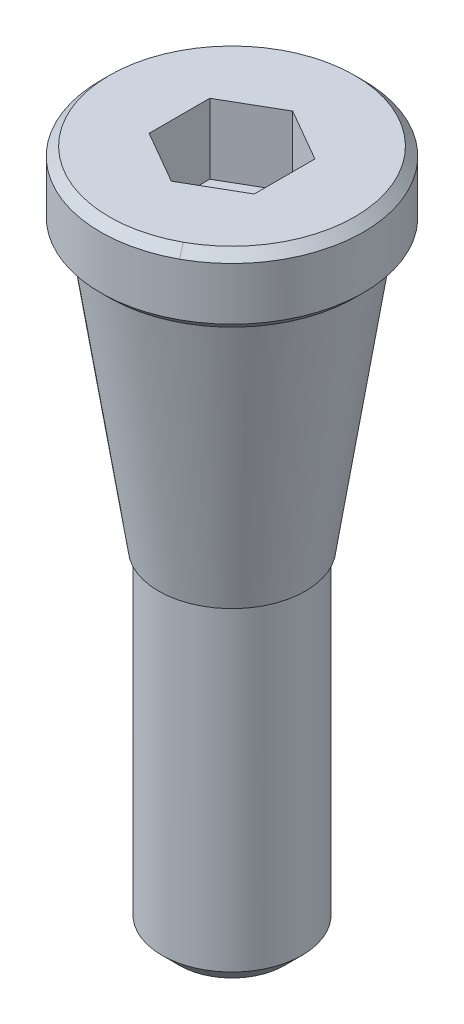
ISO-10303-21;
HEADER;
FILE_DESCRIPTION(('STEP AP214'),'2;1');
FILE_NAME('part.step','',(''),(''),'','','');
FILE_SCHEMA(('AUTOMOTIVE_DESIGN { 1 0 10303 214 1 1 1 1 }'));
ENDSEC;
DATA;
#1=APPLICATION_CONTEXT('core data for automotive mechanical design processes');
#2=APPLICATION_PROTOCOL_DEFINITION('international standard','automotive_design',2000,#1);
#3=PRODUCT_CONTEXT('',#1,'mechanical');
#4=PRODUCT('Part','Part','',(#3));
#5=PRODUCT_RELATED_PRODUCT_CATEGORY('part','',(#4));
#6=PRODUCT_DEFINITION_FORMATION('','',#4);
#7=PRODUCT_DEFINITION_CONTEXT('part definition',#1,'design');
#8=PRODUCT_DEFINITION('design','',#6,#7);
#9=PRODUCT_DEFINITION_SHAPE('','',#8);
#10=(LENGTH_UNIT() NAMED_UNIT(*) SI_UNIT(.MILLI.,.METRE.));
#11=(NAMED_UNIT(*) PLANE_ANGLE_UNIT() SI_UNIT($,.RADIAN.));
#12=(NAMED_UNIT(*) SI_UNIT($,.STERADIAN.) SOLID_ANGLE_UNIT());
#13=UNCERTAINTY_MEASURE_WITH_UNIT(LENGTH_MEASURE(1.E-05),#10,'distance_accuracy_value','');
#14=(GEOMETRIC_REPRESENTATION_CONTEXT(3) GLOBAL_UNCERTAINTY_ASSIGNED_CONTEXT((#13)) GLOBAL_UNIT_ASSIGNED_CONTEXT((#10,
#11,#12)) REPRESENTATION_CONTEXT('',''));
#15=CARTESIAN_POINT('',(0.,0.,0.));
#16=DIRECTION('',(0.,0.,1.));
#17=DIRECTION('',(1.,0.,0.));
#18=AXIS2_PLACEMENT_3D('',#15,#16,#17);
#19=CARTESIAN_POINT('',(0.,25.,7.50000000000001));
#20=DIRECTION('',(0.,1.,0.));
#21=DIRECTION('',(0.,0.,1.));
#22=AXIS2_PLACEMENT_3D('',#19,#20,#21);
#23=PLANE('',#22);
#24=DIRECTION('',(0.866025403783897,0.,-0.50000000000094));
#25=VECTOR('',#24,1.);
#26=CARTESIAN_POINT('',(-3.71924713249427E-12,25.,-3.46410161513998));
#27=LINE('',#26,#25);
#28=CARTESIAN_POINT('',(-2.99999999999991,25.,-1.73205080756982));
#29=VERTEX_POINT('',#28);
#30=CARTESIAN_POINT('',(-3.03923552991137E-12,25.,-3.46410161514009));
#31=VERTEX_POINT('',#30);
#32=EDGE_CURVE('E94',#29,#31,#27,.T.);
#33=ORIENTED_EDGE('',*,*,#32,.F.);
#34=DIRECTION('',(0.,0.,1.));
#35=VECTOR('',#34,1.);
#36=CARTESIAN_POINT('',(-2.99999999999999,25.,1.73205080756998));
#37=LINE('',#36,#35);
#38=CARTESIAN_POINT('',(-3.00000000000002,25.,1.73205080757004));
#39=VERTEX_POINT('',#38);
#40=EDGE_CURVE('E280',#29,#39,#37,.T.);
#41=ORIENTED_EDGE('',*,*,#40,.T.);
#42=DIRECTION('',(0.86602540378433,0.,0.50000000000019));
#43=VECTOR('',#42,1.);
#44=CARTESIAN_POINT('',(0.,25.,3.46410161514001));
#45=LINE('',#44,#43);
#46=CARTESIAN_POINT('',(0.,25.,3.46410161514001));
#47=VERTEX_POINT('',#46);
#48=EDGE_CURVE('E287',#39,#47,#45,.T.);
#49=ORIENTED_EDGE('',*,*,#48,.T.);
#50=DIRECTION('',(-0.866025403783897,0.,0.50000000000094));
#51=VECTOR('',#50,1.);
#52=CARTESIAN_POINT('',(0.,25.,3.46410161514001));
#53=LINE('',#52,#51);
#54=CARTESIAN_POINT('',(2.99999999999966,25.,1.73205080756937));
#55=VERTEX_POINT('',#54);
#56=EDGE_CURVE('E304',#55,#47,#53,.T.);
#57=ORIENTED_EDGE('',*,*,#56,.F.);
#58=DIRECTION('',(0.,0.,1.));
#59=VECTOR('',#58,1.);
#60=CARTESIAN_POINT('',(3.00000000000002,25.,1.73205080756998));
#61=LINE('',#60,#59);
#62=CARTESIAN_POINT('',(2.99999999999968,25.,-1.73205080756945));
#63=VERTEX_POINT('',#62);
#64=EDGE_CURVE('E301',#63,#55,#61,.T.);
#65=ORIENTED_EDGE('',*,*,#64,.F.);
#66=DIRECTION('',(-0.86602540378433,0.,-0.50000000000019));
#67=VECTOR('',#66,1.);
#68=CARTESIAN_POINT('',(-2.96984659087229E-12,25.,-3.46410161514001));
#69=LINE('',#68,#67);
#70=EDGE_CURVE('E98',#63,#31,#69,.T.);
#71=ORIENTED_EDGE('',*,*,#70,.T.);
#72=EDGE_LOOP('',(#33,#41,#49,#57,#65,#71));
#73=FACE_BOUND('',#72,.T.);
#74=ADVANCED_FACE('F16',(#73),#23,.T.);
#75=CARTESIAN_POINT('',(-3.71924713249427E-12,29.,-3.46410161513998));
#76=DIRECTION('',(0.50000000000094,0.,0.866025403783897));
#77=DIRECTION('',(0.866025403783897,0.,-0.50000000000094));
#78=AXIS2_PLACEMENT_3D('',#75,#76,#77);
#79=PLANE('',#78);
#80=DIRECTION('',(0.,1.,0.));
#81=VECTOR('',#80,1.);
#82=CARTESIAN_POINT('',(-3.,29.,-1.73205080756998));
#83=LINE('',#82,#81);
#84=CARTESIAN_POINT('',(-2.99999999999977,29.,-1.73205080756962));
#85=VERTEX_POINT('',#84);
#86=EDGE_CURVE('E113',#85,#29,#83,.F.);
#87=ORIENTED_EDGE('',*,*,#86,.T.);
#88=ORIENTED_EDGE('',*,*,#32,.T.);
#89=DIRECTION('',(0.,1.,0.));
#90=VECTOR('',#89,1.);
#91=CARTESIAN_POINT('',(-2.96984659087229E-12,29.,-3.46410161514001));
#92=LINE('',#91,#90);
#93=CARTESIAN_POINT('',(-3.08086889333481E-12,29.,-3.46410161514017));
#94=VERTEX_POINT('',#93);
#95=EDGE_CURVE('E85',#31,#94,#92,.T.);
#96=ORIENTED_EDGE('',*,*,#95,.T.);
#97=DIRECTION('',(0.866025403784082,0.,-0.500000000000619));
#98=VECTOR('',#97,1.);
#99=CARTESIAN_POINT('',(-3.,29.,-1.73205080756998));
#100=LINE('',#99,#98);
#101=EDGE_CURVE('E90',#85,#94,#100,.T.);
#102=ORIENTED_EDGE('',*,*,#101,.F.);
#103=EDGE_LOOP('',(#87,#88,#96,#102));
#104=FACE_BOUND('',#103,.T.);
#105=ADVANCED_FACE('F88',(#104),#79,.T.);
#106=CARTESIAN_POINT('',(-2.96984659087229E-12,29.,-3.46410161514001));
#107=DIRECTION('',(0.50000000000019,0.,-0.86602540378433));
#108=DIRECTION('',(-0.86602540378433,0.,-0.50000000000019));
#109=AXIS2_PLACEMENT_3D('',#106,#107,#108);
#110=PLANE('',#109);
#111=DIRECTION('',(0.866025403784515,0.,0.499999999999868));
#112=VECTOR('',#111,1.);
#113=CARTESIAN_POINT('',(-2.96984659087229E-12,29.,-3.46410161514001));
#114=LINE('',#113,#112);
#115=CARTESIAN_POINT('',(2.99999999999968,29.,-1.73205080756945));
#116=VERTEX_POINT('',#115);
#117=EDGE_CURVE('E101',#94,#116,#114,.T.);
#118=ORIENTED_EDGE('',*,*,#117,.F.);
#119=ORIENTED_EDGE('',*,*,#95,.F.);
#120=ORIENTED_EDGE('',*,*,#70,.F.);
#121=DIRECTION('',(0.,1.,0.));
#122=VECTOR('',#121,1.);
#123=CARTESIAN_POINT('',(3.,29.,-1.73205080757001));
#124=LINE('',#123,#122);
#125=EDGE_CURVE('E97',#116,#63,#124,.F.);
#126=ORIENTED_EDGE('',*,*,#125,.F.);
#127=EDGE_LOOP('',(#118,#119,#120,#126));
#128=FACE_BOUND('',#127,.T.);
#129=ADVANCED_FACE('F102',(#128),#110,.F.);
#130=CARTESIAN_POINT('',(3.00000000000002,29.,1.73205080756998));
#131=DIRECTION('',(-1.,0.,0.));
#132=DIRECTION('',(0.,0.,1.));
#133=AXIS2_PLACEMENT_3D('',#130,#131,#132);
#134=PLANE('',#133);
#135=ORIENTED_EDGE('',*,*,#125,.T.);
#136=ORIENTED_EDGE('',*,*,#64,.T.);
#137=DIRECTION('',(0.,1.,0.));
#138=VECTOR('',#137,1.);
#139=CARTESIAN_POINT('',(2.9999999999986,29.,1.73205080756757));
#140=LINE('',#139,#138);
#141=CARTESIAN_POINT('',(2.99999999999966,29.,1.73205080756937));
#142=VERTEX_POINT('',#141);
#143=EDGE_CURVE('E299',#142,#55,#140,.F.);
#144=ORIENTED_EDGE('',*,*,#143,.F.);
#145=DIRECTION('',(0.,0.,1.));
#146=VECTOR('',#145,1.);
#147=CARTESIAN_POINT('',(3.00000000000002,29.,7.49999999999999));
#148=LINE('',#147,#146);
#149=EDGE_CURVE('E107',#116,#142,#148,.T.);
#150=ORIENTED_EDGE('',*,*,#149,.F.);
#151=EDGE_LOOP('',(#135,#136,#144,#150));
#152=FACE_BOUND('',#151,.T.);
#153=ADVANCED_FACE('F262',(#152),#134,.T.);
#154=CARTESIAN_POINT('',(0.,29.,3.46410161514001));
#155=DIRECTION('',(-0.50000000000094,0.,-0.866025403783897));
#156=DIRECTION('',(-0.866025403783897,0.,0.50000000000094));
#157=AXIS2_PLACEMENT_3D('',#154,#155,#156);
#158=PLANE('',#157);
#159=ORIENTED_EDGE('',*,*,#143,.T.);
#160=ORIENTED_EDGE('',*,*,#56,.T.);
#161=DIRECTION('',(0.,1.,0.));
#162=VECTOR('',#161,1.);
#163=CARTESIAN_POINT('',(0.,29.,3.46410161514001));
#164=LINE('',#163,#162);
#165=CARTESIAN_POINT('',(0.,29.,3.46410161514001));
#166=VERTEX_POINT('',#165);
#167=EDGE_CURVE('E284',#47,#166,#164,.T.);
#168=ORIENTED_EDGE('',*,*,#167,.T.);
#169=DIRECTION('',(-0.866025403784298,0.,0.500000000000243));
#170=VECTOR('',#169,1.);
#171=CARTESIAN_POINT('',(3.00000000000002,29.,1.73205080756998));
#172=LINE('',#171,#170);
#173=EDGE_CURVE('E293',#142,#166,#172,.T.);
#174=ORIENTED_EDGE('',*,*,#173,.F.);
#175=EDGE_LOOP('',(#159,#160,#168,#174));
#176=FACE_BOUND('',#175,.T.);
#177=ADVANCED_FACE('F259',(#176),#158,.T.);
#178=CARTESIAN_POINT('',(0.,29.,3.46410161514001));
#179=DIRECTION('',(-0.50000000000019,0.,0.86602540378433));
#180=DIRECTION('',(0.86602540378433,0.,0.50000000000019));
#181=AXIS2_PLACEMENT_3D('',#178,#179,#180);
#182=PLANE('',#181);
#183=DIRECTION('',(-0.866025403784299,0.,-0.500000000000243));
#184=VECTOR('',#183,1.);
#185=CARTESIAN_POINT('',(0.,29.,3.46410161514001));
#186=LINE('',#185,#184);
#187=CARTESIAN_POINT('',(-3.00000000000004,29.,1.73205080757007));
#188=VERTEX_POINT('',#187);
#189=EDGE_CURVE('E291',#166,#188,#186,.T.);
#190=ORIENTED_EDGE('',*,*,#189,.F.);
#191=ORIENTED_EDGE('',*,*,#167,.F.);
#192=ORIENTED_EDGE('',*,*,#48,.F.);
#193=DIRECTION('',(0.,1.,0.));
#194=VECTOR('',#193,1.);
#195=CARTESIAN_POINT('',(-2.99999999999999,29.,1.73205080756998));
#196=LINE('',#195,#194);
#197=EDGE_CURVE('E64',#39,#188,#196,.T.);
#198=ORIENTED_EDGE('',*,*,#197,.T.);
#199=EDGE_LOOP('',(#190,#191,#192,#198));
#200=FACE_BOUND('',#199,.T.);
#201=ADVANCED_FACE('F253',(#200),#182,.F.);
#202=CARTESIAN_POINT('',(-2.99999999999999,29.,1.73205080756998));
#203=DIRECTION('',(-1.,0.,0.));
#204=DIRECTION('',(0.,0.,1.));
#205=AXIS2_PLACEMENT_3D('',#202,#203,#204);
#206=PLANE('',#205);
#207=DIRECTION('',(0.,0.,1.));
#208=VECTOR('',#207,1.);
#209=CARTESIAN_POINT('',(-2.99999999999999,29.,7.49999999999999));
#210=LINE('',#209,#208);
#211=EDGE_CURVE('E112',#188,#85,#210,.F.);
#212=ORIENTED_EDGE('',*,*,#211,.F.);
#213=ORIENTED_EDGE('',*,*,#197,.F.);
#214=ORIENTED_EDGE('',*,*,#40,.F.);
#215=ORIENTED_EDGE('',*,*,#86,.F.);
#216=EDGE_LOOP('',(#212,#213,#214,#215));
#217=FACE_BOUND('',#216,.T.);
#218=ADVANCED_FACE('F249',(#217),#206,.F.);
#219=CARTESIAN_POINT('',(0.,29.,7.50000000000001));
#220=DIRECTION('',(0.,1.,0.));
#221=DIRECTION('',(0.,0.,1.));
#222=AXIS2_PLACEMENT_3D('',#219,#220,#221);
#223=PLANE('',#222);
#224=ORIENTED_EDGE('',*,*,#189,.T.);
#225=ORIENTED_EDGE('',*,*,#211,.T.);
#226=ORIENTED_EDGE('',*,*,#101,.T.);
#227=ORIENTED_EDGE('',*,*,#117,.T.);
#228=ORIENTED_EDGE('',*,*,#149,.T.);
#229=ORIENTED_EDGE('',*,*,#173,.T.);
#230=EDGE_LOOP('',(#224,#225,#226,#227,#228,#229));
#231=FACE_BOUND('',#230,.T.);
#232=CARTESIAN_POINT('',(0.,29.0000000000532,0.));
#233=DIRECTION('',(0.,-1.,0.));
#234=DIRECTION('',(1.,0.,0.));
#235=AXIS2_PLACEMENT_3D('',#232,#233,#234);
#236=CIRCLE('',#235,7.00000000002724);
#237=CARTESIAN_POINT('',(3.3559787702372,28.999999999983,6.14307793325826));
#238=VERTEX_POINT('',#237);
#239=CARTESIAN_POINT('',(-3.35597876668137,28.999999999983,-6.14307793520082));
#240=VERTEX_POINT('',#239);
#241=EDGE_CURVE('E20',#238,#240,#236,.T.);
#242=ORIENTED_EDGE('',*,*,#241,.F.);
#243=CARTESIAN_POINT('',(0.,28.9999999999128,0.));
#244=DIRECTION('',(0.,-1.,0.));
#245=DIRECTION('',(0.,0.,-1.));
#246=AXIS2_PLACEMENT_3D('',#243,#244,#245);
#247=CIRCLE('',#246,7.00000000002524);
#248=EDGE_CURVE('E157',#240,#238,#247,.T.);
#249=ORIENTED_EDGE('',*,*,#248,.F.);
#250=EDGE_LOOP('',(#242,#249));
#251=FACE_BOUND('',#250,.T.);
#252=ADVANCED_FACE('F111',(#231,#251),#223,.T.);
#253=CARTESIAN_POINT('',(0.,28.5000000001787,0.));
#254=DIRECTION('',(0.,-1.,0.));
#255=DIRECTION('',(1.,0.,0.));
#256=AXIS2_PLACEMENT_3D('',#253,#254,#255);
#257=CONICAL_SURFACE('',#256,7.49999999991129,0.785398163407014);
#258=DIRECTION('',(-0.339005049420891,0.707106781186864,-0.620544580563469));
#259=VECTOR('',#258,1.);
#260=CARTESIAN_POINT('',(239250.603082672,-499000.,437945.291355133));
#261=LINE('',#260,#259);
#262=CARTESIAN_POINT('',(3.59569153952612,28.500000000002,6.58186921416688));
#263=VERTEX_POINT('',#262);
#264=EDGE_CURVE('E165',#238,#263,#261,.F.);
#265=ORIENTED_EDGE('',*,*,#264,.F.);
#266=ORIENTED_EDGE('',*,*,#241,.T.);
#267=CARTESIAN_POINT('',(-3.59569153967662,28.5000000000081,-6.58186921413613));
#268=CARTESIAN_POINT('',(-3.58570350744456,28.5208333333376,-6.56358624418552));
#269=CARTESIAN_POINT('',(-3.57571547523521,28.5416666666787,-6.54530327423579));
#270=CARTESIAN_POINT('',(-3.55573941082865,28.5833333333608,-6.50873733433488));
#271=CARTESIAN_POINT('',(-3.54575137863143,28.6041666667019,-6.49045436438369));
#272=CARTESIAN_POINT('',(-3.52577531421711,28.6458333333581,-6.45388842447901));
#273=CARTESIAN_POINT('',(-3.51578728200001,28.6666666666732,-6.4356054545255));
#274=CARTESIAN_POINT('',(-3.49581121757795,28.7083333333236,-6.39903951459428));
#275=CARTESIAN_POINT('',(-3.48582318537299,28.7291666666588,-6.38075654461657));
#276=CARTESIAN_POINT('',(-3.4658471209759,28.770833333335,-6.34419060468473));
#277=CARTESIAN_POINT('',(-3.45585908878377,28.791666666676,-6.3259076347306));
#278=CARTESIAN_POINT('',(-3.43588302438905,28.8333333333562,-6.28934169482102));
#279=CARTESIAN_POINT('',(-3.42589499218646,28.8541666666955,-6.27105872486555));
#280=CARTESIAN_POINT('',(-3.4059189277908,28.8958333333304,-6.23449278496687));
#281=CARTESIAN_POINT('',(-3.39593089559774,28.9166666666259,-6.21620981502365));
#282=CARTESIAN_POINT('',(-3.37595483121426,28.9583333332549,-6.17964387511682));
#283=CARTESIAN_POINT('',(-3.36596679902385,28.9791666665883,-6.1613609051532));
#284=CARTESIAN_POINT('',(-3.35597876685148,28.9999999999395,-6.14307793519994));
#285=B_SPLINE_CURVE_WITH_KNOTS('',3,(#267,#268,#269,#270,#271,#272,#273,#274,#275,#276,#277,
#278,#279,#280,#281,#282,#283,#284),.UNSPECIFIED.,.F.,.F.,(4,2,2,2,2,2,2,2,4),(0.,
0.0883883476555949,0.176776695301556,0.265165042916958,0.353553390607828,0.441941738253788,
0.530330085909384,0.618718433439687,0.707106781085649),.UNSPECIFIED.);
#286=CARTESIAN_POINT('',(-3.59569153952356,28.500000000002,-6.58186921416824));
#287=VERTEX_POINT('',#286);
#288=EDGE_CURVE('E134',#287,#240,#285,.T.);
#289=ORIENTED_EDGE('',*,*,#288,.F.);
#290=CARTESIAN_POINT('',(0.,28.5,0.));
#291=DIRECTION('',(0.,1.,0.));
#292=DIRECTION('',(0.,0.,1.));
#293=AXIS2_PLACEMENT_3D('',#290,#291,#292);
#294=CIRCLE('',#293,7.5);
#295=EDGE_CURVE('E159',#263,#287,#294,.F.);
#296=ORIENTED_EDGE('',*,*,#295,.F.);
#297=EDGE_LOOP('',(#265,#266,#289,#296));
#298=FACE_BOUND('',#297,.T.);
#299=ADVANCED_FACE('F126',(#298),#257,.T.);
#300=CARTESIAN_POINT('',(0.,28.5000000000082,0.));
#301=DIRECTION('',(0.,-1.,0.));
#302=DIRECTION('',(0.,0.,-1.));
#303=AXIS2_PLACEMENT_3D('',#300,#301,#302);
#304=CONICAL_SURFACE('',#303,7.49999999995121,0.785398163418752);
#305=ORIENTED_EDGE('',*,*,#288,.T.);
#306=ORIENTED_EDGE('',*,*,#248,.T.);
#307=ORIENTED_EDGE('',*,*,#264,.T.);
#308=CARTESIAN_POINT('',(0.,28.5,0.));
#309=DIRECTION('',(0.,1.,0.));
#310=DIRECTION('',(0.,0.,1.));
#311=AXIS2_PLACEMENT_3D('',#308,#309,#310);
#312=CIRCLE('',#311,7.5);
#313=EDGE_CURVE('E156',#287,#263,#312,.F.);
#314=ORIENTED_EDGE('',*,*,#313,.F.);
#315=EDGE_LOOP('',(#305,#306,#307,#314));
#316=FACE_BOUND('',#315,.T.);
#317=ADVANCED_FACE('F128',(#316),#304,.T.);
#318=CARTESIAN_POINT('',(0.,-9.99999999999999,4.00000000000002));
#319=DIRECTION('',(0.,1.,0.));
#320=DIRECTION('',(0.,0.,1.));
#321=AXIS2_PLACEMENT_3D('',#318,#319,#320);
#322=PLANE('',#321);
#323=CARTESIAN_POINT('',(0.,-9.999999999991,0.));
#324=DIRECTION('',(0.,1.,0.));
#325=DIRECTION('',(0.,0.,1.));
#326=AXIS2_PLACEMENT_3D('',#323,#324,#325);
#327=CIRCLE('',#326,3.00000000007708);
#328=CARTESIAN_POINT('',(-1.43827649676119,-9.99999999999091,-2.63274775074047));
#329=VERTEX_POINT('',#328);
#330=CARTESIAN_POINT('',(1.43827661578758,-9.99999999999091,2.63274768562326));
#331=VERTEX_POINT('',#330);
#332=EDGE_CURVE('E151',#329,#331,#327,.T.);
#333=ORIENTED_EDGE('',*,*,#332,.F.);
#334=CARTESIAN_POINT('',(0.,-9.99999999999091,0.));
#335=DIRECTION('',(0.,1.,0.));
#336=DIRECTION('',(0.,0.,1.));
#337=AXIS2_PLACEMENT_3D('',#334,#335,#336);
#338=CIRCLE('',#337,2.99999999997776);
#339=EDGE_CURVE('E155',#331,#329,#338,.T.);
#340=ORIENTED_EDGE('',*,*,#339,.F.);
#341=EDGE_LOOP('',(#333,#340));
#342=FACE_BOUND('',#341,.T.);
#343=ADVANCED_FACE('F234',(#342),#322,.F.);
#344=CARTESIAN_POINT('',(0.,9.49999999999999,0.));
#345=DIRECTION('',(0.,1.,0.));
#346=DIRECTION('',(0.,0.,1.));
#347=AXIS2_PLACEMENT_3D('',#344,#345,#346);
#348=CYLINDRICAL_SURFACE('',#347,7.5);
#349=ORIENTED_EDGE('',*,*,#295,.T.);
#350=ORIENTED_EDGE('',*,*,#313,.T.);
#351=EDGE_LOOP('',(#349,#350));
#352=FACE_BOUND('',#351,.T.);
#353=CARTESIAN_POINT('',(0.,25.5000000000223,0.));
#354=DIRECTION('',(0.,1.,0.));
#355=DIRECTION('',(0.479425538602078,0.,0.877582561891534));
#356=AXIS2_PLACEMENT_3D('',#353,#354,#355);
#357=CIRCLE('',#356,7.5000000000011);
#358=CARTESIAN_POINT('',(3.59569153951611,25.5000000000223,6.58186921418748));
#359=VERTEX_POINT('',#358);
#360=EDGE_CURVE('E176',#359,#359,#357,.F.);
#361=ORIENTED_EDGE('',*,*,#360,.F.);
#362=EDGE_LOOP('',(#361));
#363=FACE_BOUND('',#362,.T.);
#364=ADVANCED_FACE('F232',(#352,#363),#348,.T.);
#365=CARTESIAN_POINT('',(0.,-9.00000000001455,0.));
#366=DIRECTION('',(0.,1.,0.));
#367=DIRECTION('',(0.,0.,1.));
#368=AXIS2_PLACEMENT_3D('',#365,#366,#367);
#369=CONICAL_SURFACE('',#368,3.99999999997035,0.785398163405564);
#370=CARTESIAN_POINT('',(-1.91770215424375,-9.0000000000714,-3.51033024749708));
#371=CARTESIAN_POINT('',(-1.89772608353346,-9.04166666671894,-3.47376431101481));
#372=CARTESIAN_POINT('',(-1.87775001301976,-9.08333333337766,-3.43719837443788));
#373=CARTESIAN_POINT('',(-1.83779787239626,-9.16666666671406,-3.36406650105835));
#374=CARTESIAN_POINT('',(-1.81782180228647,-9.20833333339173,-3.32750056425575));
#375=CARTESIAN_POINT('',(-1.77786966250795,-9.2916666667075,-3.25436869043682));
#376=CARTESIAN_POINT('',(-1.75789359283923,-9.33333333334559,-3.2178027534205));
#377=CARTESIAN_POINT('',(-1.71794145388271,-9.4166666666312,-3.14467087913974));
#378=CARTESIAN_POINT('',(-1.69796538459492,-9.45833333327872,-3.1081049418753));
#379=CARTESIAN_POINT('',(-1.65801324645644,-9.54166666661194,-3.0349730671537));
#380=CARTESIAN_POINT('',(-1.63803717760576,-9.58333333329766,-2.99840712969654));
#381=CARTESIAN_POINT('',(-1.59808504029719,-9.66666666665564,-2.92527525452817));
#382=CARTESIAN_POINT('',(-1.5781089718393,-9.70833333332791,-2.88870931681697));
#383=CARTESIAN_POINT('',(-1.53815683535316,-9.79166666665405,-2.81557744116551));
#384=CARTESIAN_POINT('',(-1.51818076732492,-9.83333333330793,-2.77901150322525));
#385=CARTESIAN_POINT('',(-1.47822863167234,-9.91666666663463,-2.70587962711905));
#386=CARTESIAN_POINT('',(-1.458252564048,-9.95833333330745,-2.66931368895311));
#387=CARTESIAN_POINT('',(-1.43827649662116,-9.99999999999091,-2.63274775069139));
#388=B_SPLINE_CURVE_WITH_KNOTS('',3,(#370,#371,#372,#373,#374,#375,#376,#377,#378,#379,#380,
#381,#382,#383,#384,#385,#386,#387),.UNSPECIFIED.,.F.,.F.,(4,2,2,2,2,2,2,2,4),(0.,
0.176776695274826,0.353553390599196,0.530330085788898,0.707106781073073,0.883883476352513,
1.06066017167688,1.23743686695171,1.41421356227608),.UNSPECIFIED.);
#389=CARTESIAN_POINT('',(-1.91770215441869,-9.00000000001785,-3.51033024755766));
#390=VERTEX_POINT('',#389);
#391=EDGE_CURVE('E35',#390,#329,#388,.T.);
#392=ORIENTED_EDGE('',*,*,#391,.F.);
#393=CARTESIAN_POINT('',(0.,-9.00000000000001,0.));
#394=DIRECTION('',(0.,1.,0.));
#395=DIRECTION('',(0.,0.,1.));
#396=AXIS2_PLACEMENT_3D('',#393,#394,#395);
#397=CIRCLE('',#396,4.);
#398=CARTESIAN_POINT('',(1.91770215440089,-9.00000000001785,3.51033024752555));
#399=VERTEX_POINT('',#398);
#400=EDGE_CURVE('E179',#399,#390,#397,.T.);
#401=ORIENTED_EDGE('',*,*,#400,.F.);
#402=DIRECTION('',(-0.339005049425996,-0.707106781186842,-0.620544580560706));
#403=VECTOR('',#402,1.);
#404=CARTESIAN_POINT('',(239239.576298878,498999.999999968,437925.106954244));
#405=LINE('',#404,#403);
#406=EDGE_CURVE('E154',#331,#399,#405,.F.);
#407=ORIENTED_EDGE('',*,*,#406,.F.);
#408=ORIENTED_EDGE('',*,*,#339,.T.);
#409=EDGE_LOOP('',(#392,#401,#407,#408));
#410=FACE_BOUND('',#409,.T.);
#411=ADVANCED_FACE('F197',(#410),#369,.T.);
#412=CARTESIAN_POINT('',(0.,-9.00000000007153,0.));
#413=DIRECTION('',(0.,1.,0.));
#414=DIRECTION('',(0.,0.,1.));
#415=AXIS2_PLACEMENT_3D('',#412,#413,#414);
#416=CONICAL_SURFACE('',#415,3.99999999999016,0.785398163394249);
#417=ORIENTED_EDGE('',*,*,#406,.T.);
#418=CARTESIAN_POINT('',(0.,-9.00000000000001,0.));
#419=DIRECTION('',(0.,1.,0.));
#420=DIRECTION('',(0.,0.,1.));
#421=AXIS2_PLACEMENT_3D('',#418,#419,#420);
#422=CIRCLE('',#421,4.);
#423=EDGE_CURVE('E150',#390,#399,#422,.T.);
#424=ORIENTED_EDGE('',*,*,#423,.F.);
#425=ORIENTED_EDGE('',*,*,#391,.T.);
#426=ORIENTED_EDGE('',*,*,#332,.T.);
#427=EDGE_LOOP('',(#417,#424,#425,#426));
#428=FACE_BOUND('',#427,.T.);
#429=ADVANCED_FACE('F199',(#428),#416,.T.);
#430=CARTESIAN_POINT('',(0.,25.5000000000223,0.));
#431=DIRECTION('',(0.,1.,0.));
#432=DIRECTION('',(-1.,0.,0.));
#433=AXIS2_PLACEMENT_3D('',#430,#431,#432);
#434=CONICAL_SURFACE('',#433,7.5000000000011,0.785398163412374);
#435=CARTESIAN_POINT('',(0.,25.0000000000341,0.));
#436=DIRECTION('',(0.,1.,0.));
#437=DIRECTION('',(-1.,0.,0.));
#438=AXIS2_PLACEMENT_3D('',#435,#436,#437);
#439=CIRCLE('',#438,6.99999999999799);
#440=CARTESIAN_POINT('',(-6.99999999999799,25.0000000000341,0.));
#441=VERTEX_POINT('',#440);
#442=EDGE_CURVE('E147',#441,#441,#439,.T.);
#443=ORIENTED_EDGE('',*,*,#442,.T.);
#444=EDGE_LOOP('',(#443));
#445=FACE_BOUND('',#444,.T.);
#446=ORIENTED_EDGE('',*,*,#360,.T.);
#447=EDGE_LOOP('',(#446));
#448=FACE_BOUND('',#447,.T.);
#449=ADVANCED_FACE('F202',(#445,#448),#434,.T.);
#450=CARTESIAN_POINT('',(0.,9.49999999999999,0.));
#451=DIRECTION('',(0.,1.,0.));
#452=DIRECTION('',(0.,0.,1.));
#453=AXIS2_PLACEMENT_3D('',#450,#451,#452);
#454=CYLINDRICAL_SURFACE('',#453,4.);
#455=CARTESIAN_POINT('',(0.,9.1,0.));
#456=DIRECTION('',(0.,1.,0.));
#457=DIRECTION('',(0.,0.,1.));
#458=AXIS2_PLACEMENT_3D('',#455,#456,#457);
#459=CIRCLE('',#458,4.);
#460=CARTESIAN_POINT('',(0.,9.1,4.00000000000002));
#461=VERTEX_POINT('',#460);
#462=EDGE_CURVE('E144',#461,#461,#459,.F.);
#463=ORIENTED_EDGE('',*,*,#462,.T.);
#464=EDGE_LOOP('',(#463));
#465=FACE_BOUND('',#464,.T.);
#466=ORIENTED_EDGE('',*,*,#423,.T.);
#467=ORIENTED_EDGE('',*,*,#400,.T.);
#468=EDGE_LOOP('',(#466,#467));
#469=FACE_BOUND('',#468,.T.);
#470=ADVANCED_FACE('F206',(#465,#469),#454,.T.);
#471=CARTESIAN_POINT('',(0.,25.,7.50000000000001));
#472=DIRECTION('',(0.,1.,0.));
#473=DIRECTION('',(0.,0.,1.));
#474=AXIS2_PLACEMENT_3D('',#471,#472,#473);
#475=PLANE('',#474);
#476=CARTESIAN_POINT('',(0.,24.9999999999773,0.));
#477=DIRECTION('',(0.,1.,0.));
#478=DIRECTION('',(0.,0.,1.));
#479=AXIS2_PLACEMENT_3D('',#476,#477,#478);
#480=CIRCLE('',#479,6.58243201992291);
#481=CARTESIAN_POINT('',(0.,24.9999999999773,6.58243201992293));
#482=VERTEX_POINT('',#481);
#483=EDGE_CURVE('E26',#482,#482,#480,.F.);
#484=ORIENTED_EDGE('',*,*,#483,.F.);
#485=EDGE_LOOP('',(#484));
#486=FACE_BOUND('',#485,.T.);
#487=ORIENTED_EDGE('',*,*,#442,.F.);
#488=EDGE_LOOP('',(#487));
#489=FACE_BOUND('',#488,.T.);
#490=ADVANCED_FACE('F210',(#486,#489),#475,.F.);
#491=CARTESIAN_POINT('',(0.,9.1,4.19119787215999));
#492=DIRECTION('',(0.,1.,0.));
#493=DIRECTION('',(0.,0.,1.));
#494=AXIS2_PLACEMENT_3D('',#491,#492,#493);
#495=PLANE('',#494);
#496=ORIENTED_EDGE('',*,*,#462,.F.);
#497=EDGE_LOOP('',(#496));
#498=FACE_BOUND('',#497,.T.);
#499=CARTESIAN_POINT('',(0.,9.09999999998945,0.));
#500=DIRECTION('',(0.,1.,0.));
#501=DIRECTION('',(0.,0.,1.));
#502=AXIS2_PLACEMENT_3D('',#499,#500,#501);
#503=CIRCLE('',#502,4.19119787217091);
#504=CARTESIAN_POINT('',(0.,9.09999999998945,4.19119787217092));
#505=VERTEX_POINT('',#504);
#506=EDGE_CURVE('E11',#505,#505,#503,.T.);
#507=ORIENTED_EDGE('',*,*,#506,.F.);
#508=EDGE_LOOP('',(#507));
#509=FACE_BOUND('',#508,.T.);
#510=ADVANCED_FACE('F213',(#498,#509),#495,.F.);
#511=CARTESIAN_POINT('',(0.,24.9999999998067,0.));
#512=DIRECTION('',(0.,1.,0.));
#513=DIRECTION('',(0.,0.,1.));
#514=AXIS2_PLACEMENT_3D('',#511,#512,#513);
#515=CONICAL_SURFACE('',#514,6.58243201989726,0.149273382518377);
#516=ORIENTED_EDGE('',*,*,#506,.T.);
#517=EDGE_LOOP('',(#516));
#518=FACE_BOUND('',#517,.T.);
#519=ORIENTED_EDGE('',*,*,#483,.T.);
#520=EDGE_LOOP('',(#519));
#521=FACE_BOUND('',#520,.T.);
#522=ADVANCED_FACE('F18',(#518,#521),#515,.T.);
#523=CLOSED_SHELL('',(#74,#105,#129,#153,#177,#201,#218,#252,#299,#317,#343,#364,#411,#429,#449,
#470,#490,#510,#522));
#524=MANIFOLD_SOLID_BREP('B1',#523);
#525=ADVANCED_BREP_SHAPE_REPRESENTATION('',(#18,#524),#14);
#526=SHAPE_DEFINITION_REPRESENTATION(#9,#525);
ENDSEC;
END-ISO-10303-21;
